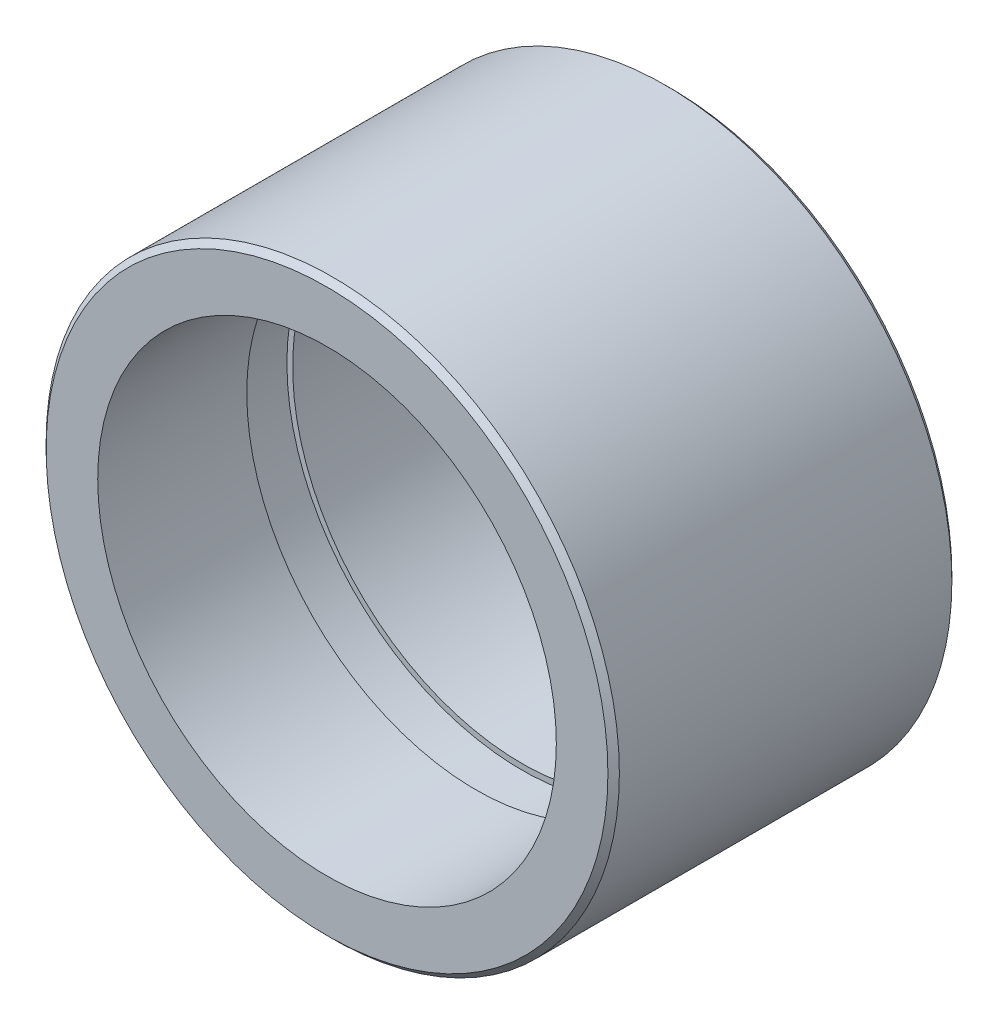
from build123d import *

# Parameters (mm, degrees)
ESQUISSE1_R      = 50
ESQUISSE1_R_2    = 40
EXTRUSION1_DEPTH = 60
ESQUISSE2_W      = 8
ESQUISSE2_H      = 11
CHANFREIN1_SIZE  = 1


with BuildPart() as part:
    # Esquisse1 → Extrusion1 (new body)
    with BuildSketch(Plane.XY):
        Circle(ESQUISSE1_R)
        Circle(ESQUISSE1_R_2, mode=Mode.SUBTRACT)
    extrude(amount=EXTRUSION1_DEPTH)

    # Esquisse2 → Enl_vement de mati_re-R_volution1 (revolve, cut)
    with BuildSketch(Plane(origin=(0, 0, 0), x_dir=(0, 0, -1), z_dir=(1, 0, 0)), mode=Mode.PRIVATE) as enl_vement_de_mati_re_r_volution1_sk:
        with Locations((-30, 35.5)):
            Rectangle(ESQUISSE2_W, ESQUISSE2_H)
    revolve(enl_vement_de_mati_re_r_volution1_sk.sketch.rotate(Axis((0, 0, 60), (0, 0, -1)), 90), axis=Axis((0, 0, 60), (0, 0, -1)), mode=Mode.SUBTRACT)

    # Chanfrein1
    chanfrein1_edges = [part.edges().sort_by_distance(p)[0] for p in [
        (-50, 0, 0),
        (-50, 0, 60),
    ]]
    chamfer(chanfrein1_edges, length=CHANFREIN1_SIZE)


solid = part.part
